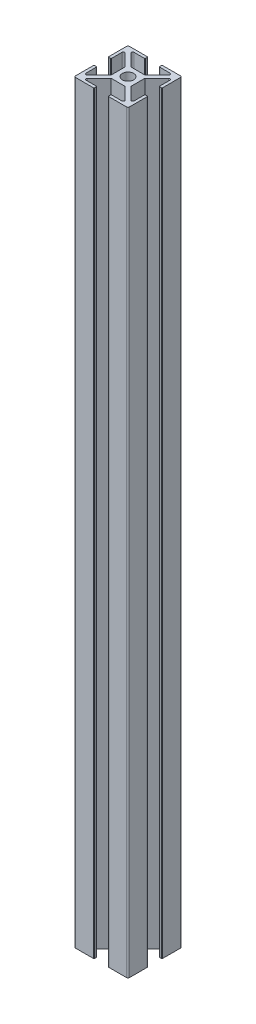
from build123d import *

# Parameters (mm, degrees)
BOSS_EXTRUDE1_DEPTH      = 280
FILLET1_R                = 0.5
FILLET2_R                = 0.25
CIRPATTERN1_COUNT        = 4
FILLET1_OF_CIRPATTERN1_R = 0.5
FILLET2_OF_CIRPATTERN1_R = 0.25


with BuildPart() as part:
    # Sketch2 → Boss-Extrude1 (new body)
    with BuildSketch(Plane(origin=(0, 0, 0), x_dir=(1, 0, 0), z_dir=(0, 1, 0))):
        Polygon((10, 8.939339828), (8.939339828, 7.878679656), (8.939339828, 2.63), (10, 2.63), align=None)
        Polygon((5.995, 7.055660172), (2.599339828, 3.66), (3.66, 3.66), (3.66, 2.599339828), (8.939339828, 7.878679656), (8.939339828, 8.939339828), (7.878679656, 8.939339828), align=None)
        Polygon((8.939339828, 10), (7.878679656, 8.939339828), (8.939339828, 8.939339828), align=None)
        Polygon((10, 8.939339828), (8.939339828, 10), (8.939339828, 8.939339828), align=None)
        Polygon((10, 10), (8.939339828, 10), (10, 8.939339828), align=None)
        Polygon((8.939339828, 8.939339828), (8.939339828, 7.878679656), (10, 8.939339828), align=None)
        Polygon((5.995, 8.939339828), (7.878679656, 8.939339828), (8.939339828, 10), (2.63, 10), (2.63, 8.939339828), align=None)
        with BuildLine():
            Line((2.599339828, 3.66), (0.852877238, 1.913537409))
            ThreePointArc((0.852877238, 1.913537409), (1.481388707, 1.481388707), (1.913537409, 0.852877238))
            Line((1.913537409, 0.852877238), (3.66, 2.599339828))
            Line((3.66, 2.599339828), (3.66, 3.66))
            Line((3.66, 3.66), (2.599339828, 3.66))
        make_face()
        with BuildLine():
            Line((-0.852877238, -1.913537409), (-2.599339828, -3.66))
            Line((-2.599339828, -3.66), (3.66, -3.66))
            Line((3.66, -3.66), (3.66, 2.599339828))
            Line((3.66, 2.599339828), (1.913537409, 0.852877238))
            ThreePointArc((1.913537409, 0.852877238), (2.04913224, 0.435984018), (2.095, 0))
            ThreePointArc((2.095, 0), (1.140668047, -1.757242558), (-0.852877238, -1.913537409))
        make_face()
        with BuildLine():
            Line((-3.66, 3.66), (-3.66, -2.599339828))
            Line((-3.66, -2.599339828), (-1.913537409, -0.852877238))
            ThreePointArc((-1.913537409, -0.852877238), (-1.481388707, 1.481388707), (0.852877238, 1.913537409))
            Line((0.852877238, 1.913537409), (2.599339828, 3.66))
            Line((2.599339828, 3.66), (-3.66, 3.66))
        make_face()
        with BuildLine():
            Line((-1.913537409, -0.852877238), (-3.66, -2.599339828))
            Line((-3.66, -2.599339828), (-3.66, -3.66))
            Line((-3.66, -3.66), (-2.599339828, -3.66))
            Line((-2.599339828, -3.66), (-0.852877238, -1.913537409))
            ThreePointArc((-0.852877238, -1.913537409), (-1.481388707, -1.481388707), (-1.913537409, -0.852877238))
        make_face()
    boss_extrude1 = extrude(amount=BOSS_EXTRUDE1_DEPTH)

    # Fillet1
    fillet1_edges = [part.edges().sort_by_distance(p)[0] for p in [
        (8.939339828, 140, -7.878679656),
        (7.878679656, 140, -8.939339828),
        (10, 140, -10),
    ]]
    fillet(fillet1_edges, radius=FILLET1_R)

    # Fillet2
    fillet2_edges = [part.edges().sort_by_distance(p)[0] for p in [
        (10, 140, -2.63),
        (8.939339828, 140, -2.63),
        (2.63, 140, -8.939339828),
        (2.63, 140, -10),
    ]]
    fillet(fillet2_edges, radius=FILLET2_R)

    # CirPattern1: Boss-Extrude1 ×4 about axis
    cirpattern1_axis = Axis((0, 0, 0), (0, 1, 0))
    for i in range(1, CIRPATTERN1_COUNT):
        add(boss_extrude1.rotate(cirpattern1_axis, i * 360 / CIRPATTERN1_COUNT))

    # Fillet1 of CirPattern1
    fillet1_of_cirpattern1_edges = [part.edges().sort_by_distance(p)[0] for p in [
        (-7.878679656, 140, -8.939339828),
        (-8.939339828, 140, -7.878679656),
        (-10, 140, -10),
        (-8.939339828, 140, 7.878679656),
        (-7.878679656, 140, 8.939339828),
        (-10, 140, 10),
        (7.878679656, 140, 8.939339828),
        (8.939339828, 140, 7.878679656),
        (10, 140, 10),
    ]]
    fillet(fillet1_of_cirpattern1_edges, radius=FILLET1_OF_CIRPATTERN1_R)

    # Fillet2 of CirPattern1
    fillet2_of_cirpattern1_edges = [part.edges().sort_by_distance(p)[0] for p in [
        (-2.63, 140, -10),
        (-2.63, 140, -8.939339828),
        (-8.939339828, 140, -2.63),
        (-10, 140, -2.63),
        (-10, 140, 2.63),
        (-8.939339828, 140, 2.63),
        (-2.63, 140, 8.939339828),
        (-2.63, 140, 10),
        (2.63, 140, 10),
        (2.63, 140, 8.939339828),
        (8.939339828, 140, 2.63),
        (10, 140, 2.63),
    ]]
    fillet(fillet2_of_cirpattern1_edges, radius=FILLET2_OF_CIRPATTERN1_R)


solid = part.part
